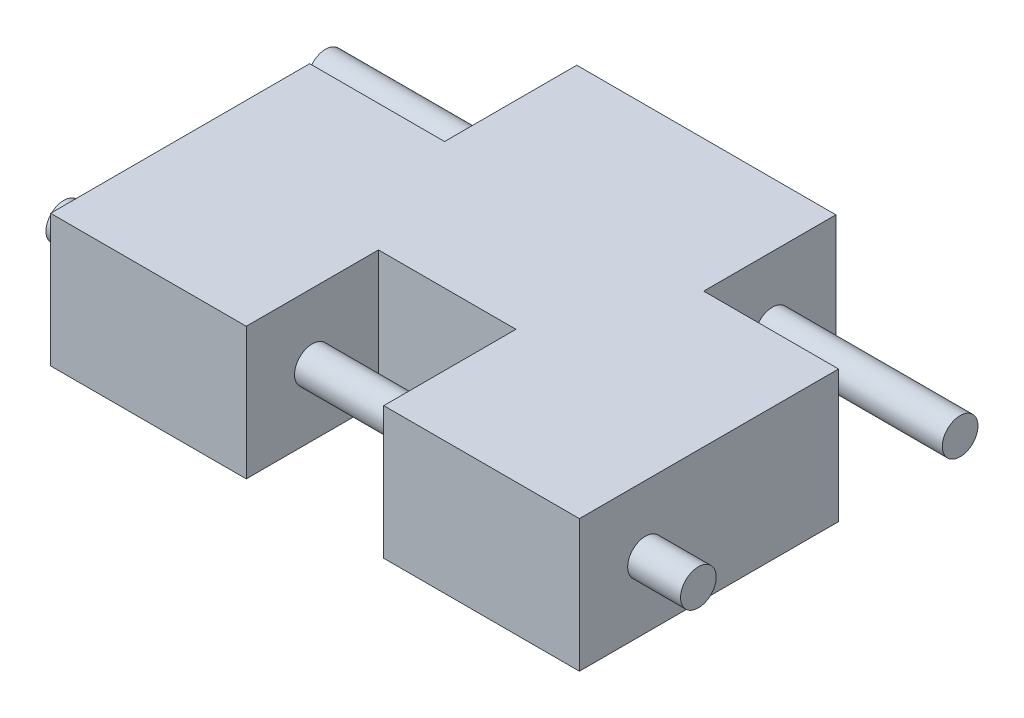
from build123d import *

# Parameters (mm, degrees)
FINGERBASE_DEPTH         = 6.35
BOSS_EXTRUDE1_DEPTH      = 2.54
BOSS_EXTRUDE1_DEPTH_BACK = 27.94
SKETCH2_R                = 0.85725


with BuildPart() as part:
    # Sketch1 → FingerBase (new body)
    with BuildSketch(Plane(origin=(0, 0, 0), x_dir=(1, 0, 0), z_dir=(0, 1, 0))):
        Polygon((-6.223, 6.223), (6.223, 6.223), (6.223, -0.127), (12.7, -0.127), (12.7, -12.573), (3.302, -12.573), (3.302, -6.223), (-3.302, -6.223), (-3.302, -12.573), (-12.7, -12.573), (-12.7, -0.127), (-6.223, -0.127), align=None)
    extrude(amount=FINGERBASE_DEPTH)

    # Sketch2 → Boss-Extrude1 (add, two sides: drawn at the far end of the back side and taken through both)
    with BuildSketch(Plane(origin=(12.7, 0, 0), x_dir=(0, 0, -1), z_dir=(1, 0, 0)).offset(-BOSS_EXTRUDE1_DEPTH_BACK)):
        with Locations((-9.398, 3.175)):
            Circle(SKETCH2_R)
        with Locations((3.175, 3.175)):
            Circle(SKETCH2_R)
    extrude(amount=BOSS_EXTRUDE1_DEPTH + BOSS_EXTRUDE1_DEPTH_BACK)


solid = part.part
